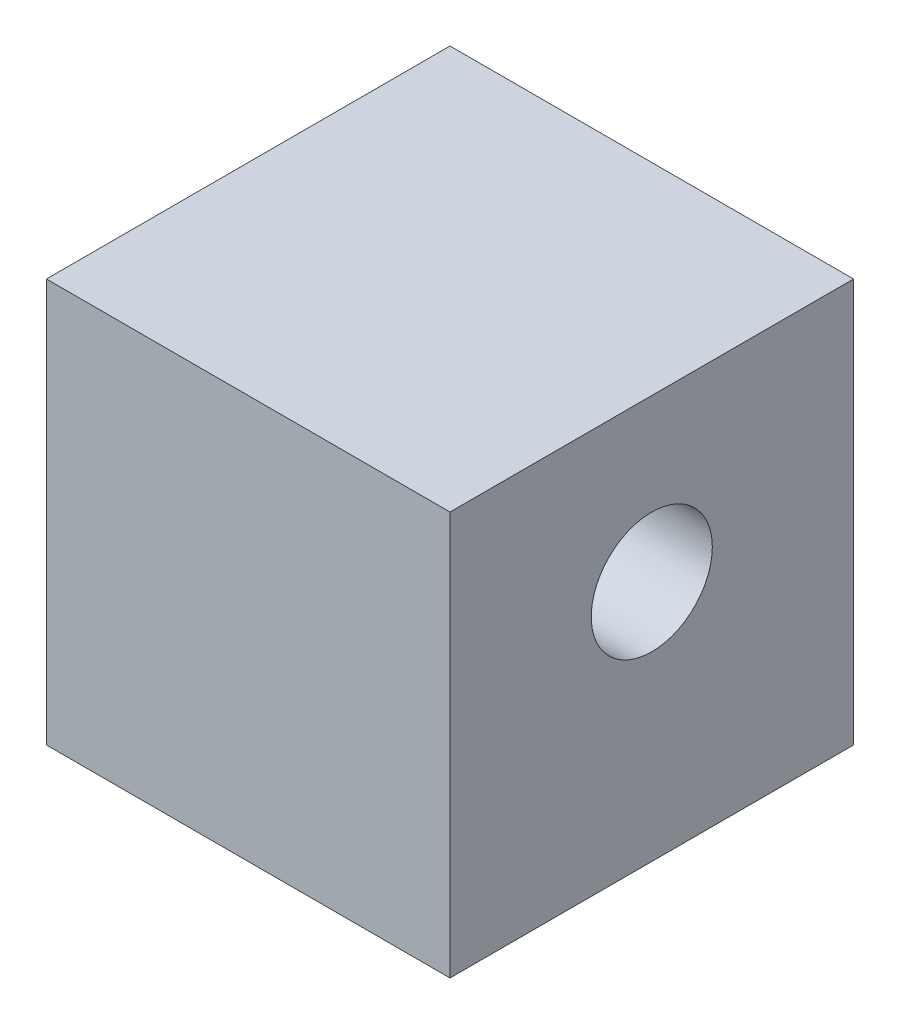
from build123d import *

# Parameters (mm, degrees)
SKETCH1_W           = 100
SKETCH1_H           = 100
BOSS_EXTRUDE1_DEPTH = 100
SKETCH2_R           = 15
CUT_EXTRUDE1_DEPTH  = 151


with BuildPart() as part:
    # Sketch1 → Boss-Extrude1 (new body)
    with BuildSketch(Plane(origin=(0, 0, 0), x_dir=(1, 0, 0), z_dir=(0, 1, 0))):
        Rectangle(SKETCH1_W, SKETCH1_H)
    extrude(amount=BOSS_EXTRUDE1_DEPTH)

    # Sketch2 → Cut-Extrude1 (cut, through all)
    with BuildSketch(Plane(origin=(50, 0, 0), x_dir=(0, 0, -1), z_dir=(1, 0, 0))):
        with Locations((0, 60)):
            Circle(SKETCH2_R)
    extrude(amount=-CUT_EXTRUDE1_DEPTH, mode=Mode.SUBTRACT)


solid = part.part
